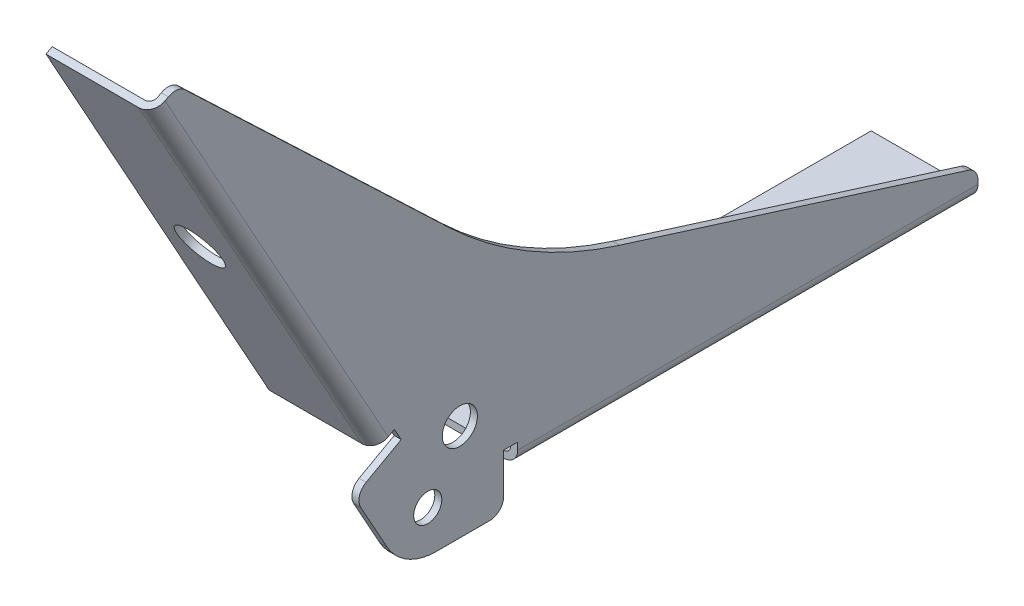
from build123d import *

# Parameters (mm, degrees)
ESQUISSE1_W             = 65.5
ESQUISSE1_H             = 1
BOSS_EXTRU_1_DEPTH      = 15.2
BOSS_EXTRU_1_2_DEPTH    = 15.2
ESQUISSE2_R             = 2
ESQUISSE2_R_2           = 2.5
BOSS_EXTRU_2_DEPTH      = 1
CONG_1_R                = 2
CONG_2_R                = 1
ESQUISSE3_R             = 3.3
ENL_V_MAT_EXTRU_1_DEPTH = 107.040209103
ESQUISSE4_R             = 3.3
ENL_V_MAT_EXTRU_2_DEPTH = 1


with BuildPart() as part:
    # Esquisse1 → Boss.-Extru.1 (new body)
    with BuildSketch(Plane(origin=(0, 0, 0), x_dir=(0, 0, -1), z_dir=(1, 0, 0))):
        with Locations((45.75, -0.5)):
            Rectangle(ESQUISSE1_W, ESQUISSE1_H)
    extrude(amount=BOSS_EXTRU_1_DEPTH)



with BuildPart() as body_2:
    # Esquisse1 → Boss.-Extru.1 2 (new body)
    with BuildSketch(Plane(origin=(0, 0, 0), x_dir=(0, 0, -1), z_dir=(1, 0, 0))):
        Polygon((-7.17714477, 10.885246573), (-6.302525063, 11.370056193), (-38.057555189, 68.65764701), (-38.932174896, 68.17283739), align=None)
    extrude(amount=BOSS_EXTRU_1_2_DEPTH)


with BuildPart() as part_1:
    add(part.part)

    add(body_2.part)  # Boss.-Extru.2 merges body 2
    # Esquisse2 → Boss.-Extru.2 (add)
    with BuildSketch(Plane(origin=(15.2, 0, 0), x_dir=(0, 0, -1), z_dir=(1, 0, 0))):
        with BuildLine():
            Line((13, -1), (78.5, -1))
            Line((78.5, -1), (78.5, 1.531336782))
            ThreePointArc((78.5, 1.531336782), (78.112042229, 2.715110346), (77.098680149, 3.439629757))
            Line((77.098680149, 3.439629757), (27.5, 19))
            ThreePointArc((27.5, 19), (14.575027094, 24.743485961), (3.285509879, 33.263424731))
            Line((3.285509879, 33.263424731), (-34.369813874, 69.099590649))
            ThreePointArc((-34.369813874, 69.099590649), (-35.494780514, 69.634643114), (-36.718217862, 69.400053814))
            Line((-36.718217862, 69.400053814), (-38.932174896, 68.17283739))
            Line((-38.932174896, 68.17283739), (-7.17714477, 10.885246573))
            Line((-7.17714477, 10.885246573), (-4.553285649, 12.339675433))
            Line((-4.553285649, 12.339675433), (-3.583666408, 10.590436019))
            Line((-3.583666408, 10.590436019), (-8.568998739, 7.827021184))
            ThreePointArc((-8.568998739, 7.827021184), (-9.521902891, 6.629056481), (-9.348618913, 5.108162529))
            Line((-9.348618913, 5.108162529), (-5.642154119, -1.578476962))
            ThreePointArc((-5.642154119, -1.578476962), (-2.705503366, -4.593033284), (1.354803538, -5.7))
            Line((1.354803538, -5.7), (9, -5.7))
            ThreePointArc((9, -5.7), (10.414213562, -5.114213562), (11, -3.7))
            Line((11, -3.7), (11, 2))
            Line((11, 2), (13, 2))
            Line((13, 2), (13, -1))
        make_face()
        with Locations((0.195211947, 0.331404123)):
            Circle(ESQUISSE2_R, mode=Mode.SUBTRACT)
        with Locations((4.763057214, 8.086066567)):
            Circle(ESQUISSE2_R_2, mode=Mode.SUBTRACT)
    extrude(amount=-BOSS_EXTRU_2_DEPTH)

    # Cong_1
    cong_1_edges = [part_1.edges().sort_by_distance(p)[0] for p in [
        (15.2, 39.529041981, 23.054659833),
        (15.2, -1, -45.75),
    ]]
    fillet(cong_1_edges, radius=CONG_1_R)

    # Cong_2
    cong_2_edges = [part_1.edges().sort_by_distance(p)[0] for p in [
        (14.2, 0, -45.75),
        (14.2, 40.013851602, 22.180040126),
    ]]
    fillet(cong_2_edges, radius=CONG_2_R)

    # Esquisse3 → Enl_v. mat.-Extru.1 (cut, through all)
    with BuildSketch(Plane(origin=(0, 0, 0), x_dir=(-1, 0, 0), z_dir=(0, 0.48480962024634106, -0.8746197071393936))):
        with Locations(Location((-6, 45.75, 0), (0, 0, 90))):
            Circle(ESQUISSE3_R)
    extrude(amount=-ENL_V_MAT_EXTRU_1_DEPTH, mode=Mode.SUBTRACT)

    # Esquisse4 → Enl_v. mat.-Extru.2 (cut)
    with BuildSketch(Plane(origin=(0, 0, 0), x_dir=(1, 0, 0), z_dir=(0, 1, 0))):
        with Locations(Location((6, 45.75, 0), (0, 0, 270))):
            Circle(ESQUISSE4_R)
    extrude(amount=-ENL_V_MAT_EXTRU_2_DEPTH, mode=Mode.SUBTRACT)


solid = part_1.part
